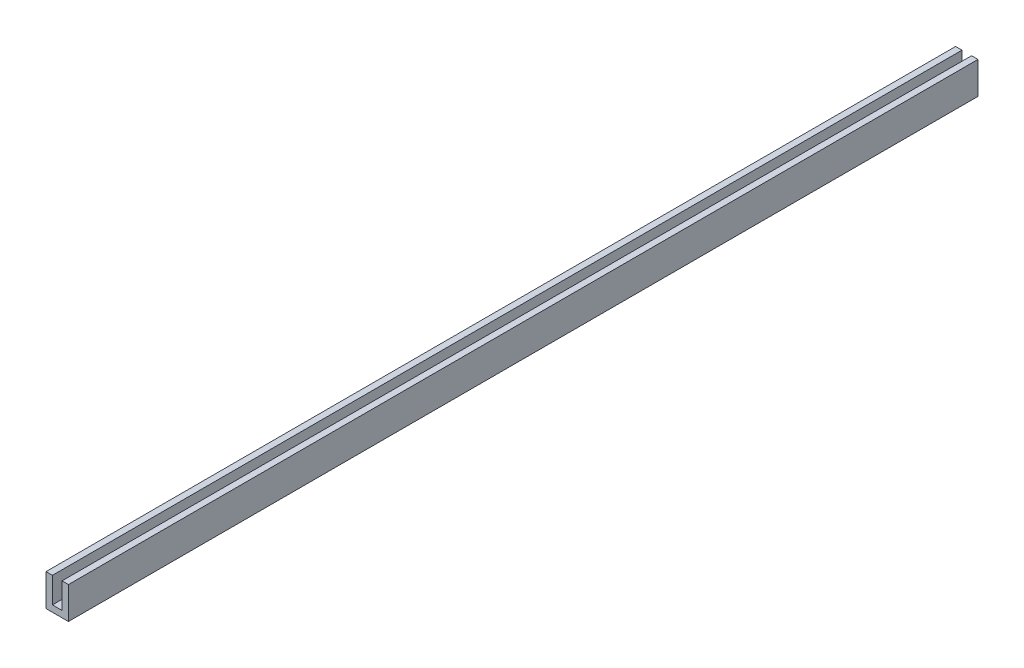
ISO-10303-21;
HEADER;
FILE_DESCRIPTION(('STEP AP214'),'2;1');
FILE_NAME('part.step','',(''),(''),'','','');
FILE_SCHEMA(('AUTOMOTIVE_DESIGN { 1 0 10303 214 1 1 1 1 }'));
ENDSEC;
DATA;
#1=APPLICATION_CONTEXT('core data for automotive mechanical design processes');
#2=APPLICATION_PROTOCOL_DEFINITION('international standard','automotive_design',2000,#1);
#3=PRODUCT_CONTEXT('',#1,'mechanical');
#4=PRODUCT('Part','Part','',(#3));
#5=PRODUCT_RELATED_PRODUCT_CATEGORY('part','',(#4));
#6=PRODUCT_DEFINITION_FORMATION('','',#4);
#7=PRODUCT_DEFINITION_CONTEXT('part definition',#1,'design');
#8=PRODUCT_DEFINITION('design','',#6,#7);
#9=PRODUCT_DEFINITION_SHAPE('','',#8);
#10=(LENGTH_UNIT() NAMED_UNIT(*) SI_UNIT(.MILLI.,.METRE.));
#11=(NAMED_UNIT(*) PLANE_ANGLE_UNIT() SI_UNIT($,.RADIAN.));
#12=(NAMED_UNIT(*) SI_UNIT($,.STERADIAN.) SOLID_ANGLE_UNIT());
#13=UNCERTAINTY_MEASURE_WITH_UNIT(LENGTH_MEASURE(1.E-05),#10,'distance_accuracy_value','');
#14=(GEOMETRIC_REPRESENTATION_CONTEXT(3) GLOBAL_UNCERTAINTY_ASSIGNED_CONTEXT((#13)) GLOBAL_UNIT_ASSIGNED_CONTEXT((#10,
#11,#12)) REPRESENTATION_CONTEXT('',''));
#15=CARTESIAN_POINT('',(0.,0.,0.));
#16=DIRECTION('',(0.,0.,1.));
#17=DIRECTION('',(1.,0.,0.));
#18=AXIS2_PLACEMENT_3D('',#15,#16,#17);
#19=CARTESIAN_POINT('',(0.,10.,284.));
#20=DIRECTION('',(0.,-1.,0.));
#21=DIRECTION('',(0.,0.,-1.));
#22=AXIS2_PLACEMENT_3D('',#19,#20,#21);
#23=PLANE('',#22);
#24=DIRECTION('',(-1.,0.,0.));
#25=VECTOR('',#24,1.);
#26=CARTESIAN_POINT('',(0.,10.,284.));
#27=LINE('',#26,#25);
#28=CARTESIAN_POINT('',(2.,10.,284.));
#29=VERTEX_POINT('',#28);
#30=CARTESIAN_POINT('',(0.,10.,284.));
#31=VERTEX_POINT('',#30);
#32=EDGE_CURVE('E49',#29,#31,#27,.T.);
#33=ORIENTED_EDGE('',*,*,#32,.F.);
#34=DIRECTION('',(0.,0.,1.));
#35=VECTOR('',#34,1.);
#36=CARTESIAN_POINT('',(2.,10.,0.));
#37=LINE('',#36,#35);
#38=CARTESIAN_POINT('',(2.,10.,0.));
#39=VERTEX_POINT('',#38);
#40=EDGE_CURVE('E108',#39,#29,#37,.T.);
#41=ORIENTED_EDGE('',*,*,#40,.F.);
#42=DIRECTION('',(-1.,0.,0.));
#43=VECTOR('',#42,1.);
#44=CARTESIAN_POINT('',(0.,10.,0.));
#45=LINE('',#44,#43);
#46=CARTESIAN_POINT('',(0.,10.,0.));
#47=VERTEX_POINT('',#46);
#48=EDGE_CURVE('E132',#39,#47,#45,.T.);
#49=ORIENTED_EDGE('',*,*,#48,.T.);
#50=DIRECTION('',(0.,0.,-1.));
#51=VECTOR('',#50,1.);
#52=CARTESIAN_POINT('',(0.,10.,284.));
#53=LINE('',#52,#51);
#54=EDGE_CURVE('E144',#31,#47,#53,.T.);
#55=ORIENTED_EDGE('',*,*,#54,.F.);
#56=EDGE_LOOP('',(#33,#41,#49,#55));
#57=FACE_BOUND('',#56,.T.);
#58=ADVANCED_FACE('F26',(#57),#23,.F.);
#59=CARTESIAN_POINT('',(0.,0.,284.));
#60=DIRECTION('',(1.,0.,0.));
#61=DIRECTION('',(0.,0.,-1.));
#62=AXIS2_PLACEMENT_3D('',#59,#60,#61);
#63=PLANE('',#62);
#64=DIRECTION('',(0.,-1.,0.));
#65=VECTOR('',#64,1.);
#66=CARTESIAN_POINT('',(0.,0.,0.));
#67=LINE('',#66,#65);
#68=CARTESIAN_POINT('',(0.,0.,0.));
#69=VERTEX_POINT('',#68);
#70=EDGE_CURVE('E121',#47,#69,#67,.T.);
#71=ORIENTED_EDGE('',*,*,#70,.T.);
#72=DIRECTION('',(0.,0.,-1.));
#73=VECTOR('',#72,1.);
#74=CARTESIAN_POINT('',(0.,0.,284.));
#75=LINE('',#74,#73);
#76=CARTESIAN_POINT('',(0.,0.,284.));
#77=VERTEX_POINT('',#76);
#78=EDGE_CURVE('E11',#77,#69,#75,.T.);
#79=ORIENTED_EDGE('',*,*,#78,.F.);
#80=DIRECTION('',(0.,-1.,0.));
#81=VECTOR('',#80,1.);
#82=CARTESIAN_POINT('',(0.,0.,284.));
#83=LINE('',#82,#81);
#84=EDGE_CURVE('E136',#31,#77,#83,.T.);
#85=ORIENTED_EDGE('',*,*,#84,.F.);
#86=ORIENTED_EDGE('',*,*,#54,.T.);
#87=EDGE_LOOP('',(#71,#79,#85,#86));
#88=FACE_BOUND('',#87,.T.);
#89=ADVANCED_FACE('F28',(#88),#63,.F.);
#90=CARTESIAN_POINT('',(0.,0.,284.));
#91=DIRECTION('',(0.,1.,0.));
#92=DIRECTION('',(0.,0.,1.));
#93=AXIS2_PLACEMENT_3D('',#90,#91,#92);
#94=PLANE('',#93);
#95=DIRECTION('',(1.,0.,0.));
#96=VECTOR('',#95,1.);
#97=CARTESIAN_POINT('',(0.,0.,0.));
#98=LINE('',#97,#96);
#99=CARTESIAN_POINT('',(7.,0.,0.));
#100=VERTEX_POINT('',#99);
#101=EDGE_CURVE('E128',#69,#100,#98,.T.);
#102=ORIENTED_EDGE('',*,*,#101,.T.);
#103=DIRECTION('',(0.,0.,-1.));
#104=VECTOR('',#103,1.);
#105=CARTESIAN_POINT('',(7.,0.,284.));
#106=LINE('',#105,#104);
#107=CARTESIAN_POINT('',(7.,0.,284.));
#108=VERTEX_POINT('',#107);
#109=EDGE_CURVE('E34',#108,#100,#106,.T.);
#110=ORIENTED_EDGE('',*,*,#109,.F.);
#111=DIRECTION('',(1.,0.,0.));
#112=VECTOR('',#111,1.);
#113=CARTESIAN_POINT('',(0.,0.,284.));
#114=LINE('',#113,#112);
#115=EDGE_CURVE('E138',#77,#108,#114,.T.);
#116=ORIENTED_EDGE('',*,*,#115,.F.);
#117=ORIENTED_EDGE('',*,*,#78,.T.);
#118=EDGE_LOOP('',(#102,#110,#116,#117));
#119=FACE_BOUND('',#118,.T.);
#120=ADVANCED_FACE('F166',(#119),#94,.F.);
#121=CARTESIAN_POINT('',(7.,0.,284.));
#122=DIRECTION('',(-1.,0.,0.));
#123=DIRECTION('',(0.,-1.,0.));
#124=AXIS2_PLACEMENT_3D('',#121,#122,#123);
#125=PLANE('',#124);
#126=DIRECTION('',(0.,1.,0.));
#127=VECTOR('',#126,1.);
#128=CARTESIAN_POINT('',(7.,0.,0.));
#129=LINE('',#128,#127);
#130=CARTESIAN_POINT('',(7.,10.,0.));
#131=VERTEX_POINT('',#130);
#132=EDGE_CURVE('E130',#100,#131,#129,.T.);
#133=ORIENTED_EDGE('',*,*,#132,.T.);
#134=DIRECTION('',(0.,0.,-1.));
#135=VECTOR('',#134,1.);
#136=CARTESIAN_POINT('',(7.,10.,284.));
#137=LINE('',#136,#135);
#138=CARTESIAN_POINT('',(7.,10.,284.));
#139=VERTEX_POINT('',#138);
#140=EDGE_CURVE('E147',#139,#131,#137,.T.);
#141=ORIENTED_EDGE('',*,*,#140,.F.);
#142=DIRECTION('',(0.,1.,0.));
#143=VECTOR('',#142,1.);
#144=CARTESIAN_POINT('',(7.,0.,284.));
#145=LINE('',#144,#143);
#146=EDGE_CURVE('E140',#108,#139,#145,.T.);
#147=ORIENTED_EDGE('',*,*,#146,.F.);
#148=ORIENTED_EDGE('',*,*,#109,.T.);
#149=EDGE_LOOP('',(#133,#141,#147,#148));
#150=FACE_BOUND('',#149,.T.);
#151=ADVANCED_FACE('F154',(#150),#125,.F.);
#152=CARTESIAN_POINT('',(5.,10.,0.));
#153=VERTEX_POINT('',#152);
#154=EDGE_CURVE('E133',#131,#153,#45,.T.);
#155=ORIENTED_EDGE('',*,*,#154,.T.);
#156=DIRECTION('',(0.,0.,1.));
#157=VECTOR('',#156,1.);
#158=CARTESIAN_POINT('',(5.,10.,0.));
#159=LINE('',#158,#157);
#160=CARTESIAN_POINT('',(5.,10.,284.));
#161=VERTEX_POINT('',#160);
#162=EDGE_CURVE('E122',#153,#161,#159,.T.);
#163=ORIENTED_EDGE('',*,*,#162,.T.);
#164=EDGE_CURVE('E142',#139,#161,#27,.T.);
#165=ORIENTED_EDGE('',*,*,#164,.F.);
#166=ORIENTED_EDGE('',*,*,#140,.T.);
#167=EDGE_LOOP('',(#155,#163,#165,#166));
#168=FACE_BOUND('',#167,.T.);
#169=ADVANCED_FACE('F162',(#168),#23,.F.);
#170=CARTESIAN_POINT('',(0.,10.,284.));
#171=DIRECTION('',(0.,0.,-1.));
#172=DIRECTION('',(-1.,0.,0.));
#173=AXIS2_PLACEMENT_3D('',#170,#171,#172);
#174=PLANE('',#173);
#175=DIRECTION('',(1.,0.,0.));
#176=VECTOR('',#175,1.);
#177=CARTESIAN_POINT('',(2.,2.,284.));
#178=LINE('',#177,#176);
#179=CARTESIAN_POINT('',(2.,2.,284.));
#180=VERTEX_POINT('',#179);
#181=CARTESIAN_POINT('',(5.,2.,284.));
#182=VERTEX_POINT('',#181);
#183=EDGE_CURVE('E97',#180,#182,#178,.T.);
#184=ORIENTED_EDGE('',*,*,#183,.F.);
#185=DIRECTION('',(0.,-1.,0.));
#186=VECTOR('',#185,1.);
#187=CARTESIAN_POINT('',(2.,10.,284.));
#188=LINE('',#187,#186);
#189=EDGE_CURVE('E105',#29,#180,#188,.T.);
#190=ORIENTED_EDGE('',*,*,#189,.F.);
#191=ORIENTED_EDGE('',*,*,#32,.T.);
#192=ORIENTED_EDGE('',*,*,#84,.T.);
#193=ORIENTED_EDGE('',*,*,#115,.T.);
#194=ORIENTED_EDGE('',*,*,#146,.T.);
#195=ORIENTED_EDGE('',*,*,#164,.T.);
#196=DIRECTION('',(0.,1.,0.));
#197=VECTOR('',#196,1.);
#198=CARTESIAN_POINT('',(5.,10.,284.));
#199=LINE('',#198,#197);
#200=EDGE_CURVE('E112',#182,#161,#199,.T.);
#201=ORIENTED_EDGE('',*,*,#200,.F.);
#202=EDGE_LOOP('',(#184,#190,#191,#192,#193,#194,#195,#201));
#203=FACE_BOUND('',#202,.T.);
#204=ADVANCED_FACE('F110',(#203),#174,.F.);
#205=CARTESIAN_POINT('',(0.,10.,0.));
#206=DIRECTION('',(0.,0.,-1.));
#207=DIRECTION('',(-1.,0.,0.));
#208=AXIS2_PLACEMENT_3D('',#205,#206,#207);
#209=PLANE('',#208);
#210=DIRECTION('',(0.,-1.,0.));
#211=VECTOR('',#210,1.);
#212=CARTESIAN_POINT('',(2.,10.,0.));
#213=LINE('',#212,#211);
#214=CARTESIAN_POINT('',(2.,2.,0.));
#215=VERTEX_POINT('',#214);
#216=EDGE_CURVE('E114',#39,#215,#213,.T.);
#217=ORIENTED_EDGE('',*,*,#216,.T.);
#218=DIRECTION('',(1.,0.,0.));
#219=VECTOR('',#218,1.);
#220=CARTESIAN_POINT('',(2.,2.,0.));
#221=LINE('',#220,#219);
#222=CARTESIAN_POINT('',(5.,2.,0.));
#223=VERTEX_POINT('',#222);
#224=EDGE_CURVE('E100',#215,#223,#221,.T.);
#225=ORIENTED_EDGE('',*,*,#224,.T.);
#226=DIRECTION('',(0.,1.,0.));
#227=VECTOR('',#226,1.);
#228=CARTESIAN_POINT('',(5.,10.,0.));
#229=LINE('',#228,#227);
#230=EDGE_CURVE('E41',#223,#153,#229,.T.);
#231=ORIENTED_EDGE('',*,*,#230,.T.);
#232=ORIENTED_EDGE('',*,*,#154,.F.);
#233=ORIENTED_EDGE('',*,*,#132,.F.);
#234=ORIENTED_EDGE('',*,*,#101,.F.);
#235=ORIENTED_EDGE('',*,*,#70,.F.);
#236=ORIENTED_EDGE('',*,*,#48,.F.);
#237=EDGE_LOOP('',(#217,#225,#231,#232,#233,#234,#235,#236));
#238=FACE_BOUND('',#237,.T.);
#239=ADVANCED_FACE('F159',(#238),#209,.T.);
#240=CARTESIAN_POINT('',(2.,10.,0.));
#241=DIRECTION('',(-1.,0.,0.));
#242=DIRECTION('',(0.,-1.,0.));
#243=AXIS2_PLACEMENT_3D('',#240,#241,#242);
#244=PLANE('',#243);
#245=ORIENTED_EDGE('',*,*,#189,.T.);
#246=DIRECTION('',(0.,0.,1.));
#247=VECTOR('',#246,1.);
#248=CARTESIAN_POINT('',(2.,2.,0.));
#249=LINE('',#248,#247);
#250=EDGE_CURVE('E93',#215,#180,#249,.T.);
#251=ORIENTED_EDGE('',*,*,#250,.F.);
#252=ORIENTED_EDGE('',*,*,#216,.F.);
#253=ORIENTED_EDGE('',*,*,#40,.T.);
#254=EDGE_LOOP('',(#245,#251,#252,#253));
#255=FACE_BOUND('',#254,.T.);
#256=ADVANCED_FACE('F106',(#255),#244,.F.);
#257=CARTESIAN_POINT('',(5.,10.,0.));
#258=DIRECTION('',(1.,0.,0.));
#259=DIRECTION('',(0.,1.,0.));
#260=AXIS2_PLACEMENT_3D('',#257,#258,#259);
#261=PLANE('',#260);
#262=ORIENTED_EDGE('',*,*,#200,.T.);
#263=ORIENTED_EDGE('',*,*,#162,.F.);
#264=ORIENTED_EDGE('',*,*,#230,.F.);
#265=DIRECTION('',(0.,0.,1.));
#266=VECTOR('',#265,1.);
#267=CARTESIAN_POINT('',(5.,2.,0.));
#268=LINE('',#267,#266);
#269=EDGE_CURVE('E103',#223,#182,#268,.T.);
#270=ORIENTED_EDGE('',*,*,#269,.T.);
#271=EDGE_LOOP('',(#262,#263,#264,#270));
#272=FACE_BOUND('',#271,.T.);
#273=ADVANCED_FACE('F214',(#272),#261,.F.);
#274=CARTESIAN_POINT('',(2.,2.,0.));
#275=DIRECTION('',(0.,-1.,0.));
#276=DIRECTION('',(0.,0.,-1.));
#277=AXIS2_PLACEMENT_3D('',#274,#275,#276);
#278=PLANE('',#277);
#279=ORIENTED_EDGE('',*,*,#183,.T.);
#280=ORIENTED_EDGE('',*,*,#269,.F.);
#281=ORIENTED_EDGE('',*,*,#224,.F.);
#282=ORIENTED_EDGE('',*,*,#250,.T.);
#283=EDGE_LOOP('',(#279,#280,#281,#282));
#284=FACE_BOUND('',#283,.T.);
#285=ADVANCED_FACE('F95',(#284),#278,.F.);
#286=CLOSED_SHELL('',(#58,#89,#120,#151,#169,#204,#239,#256,#273,#285));
#287=MANIFOLD_SOLID_BREP('B2',#286);
#288=ADVANCED_BREP_SHAPE_REPRESENTATION('',(#18,#287),#14);
#289=SHAPE_DEFINITION_REPRESENTATION(#9,#288);
ENDSEC;
END-ISO-10303-21;
